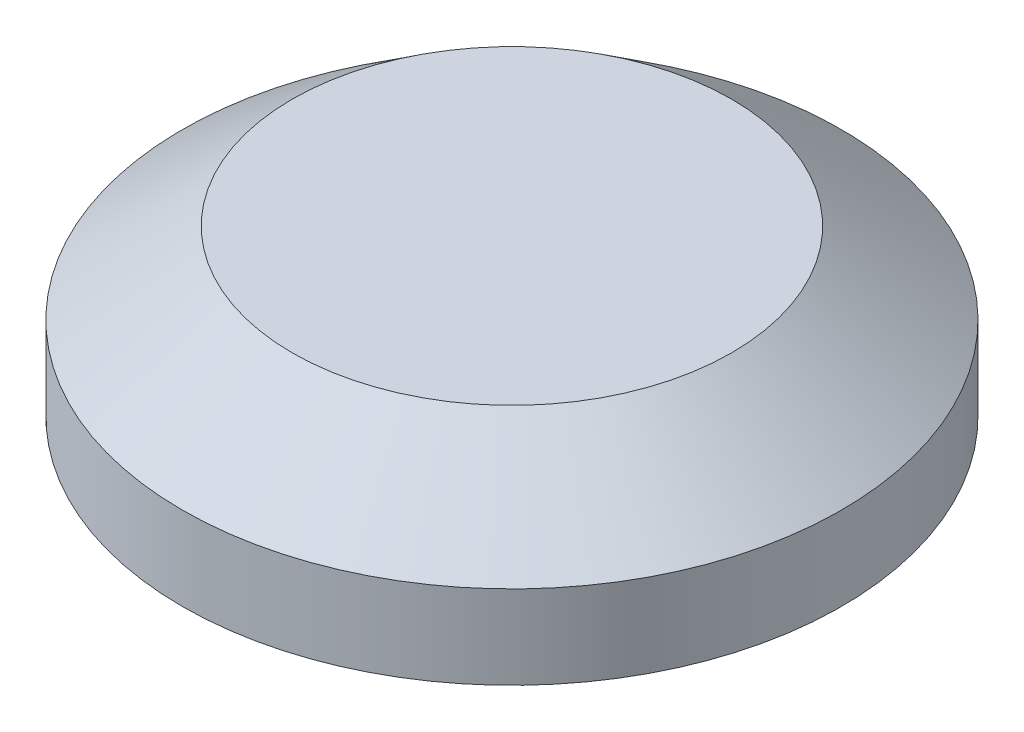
ISO-10303-21;
HEADER;
FILE_DESCRIPTION(('STEP AP214'),'2;1');
FILE_NAME('part.step','',(''),(''),'','','');
FILE_SCHEMA(('AUTOMOTIVE_DESIGN { 1 0 10303 214 1 1 1 1 }'));
ENDSEC;
DATA;
#1=APPLICATION_CONTEXT('core data for automotive mechanical design processes');
#2=APPLICATION_PROTOCOL_DEFINITION('international standard','automotive_design',2000,#1);
#3=PRODUCT_CONTEXT('',#1,'mechanical');
#4=PRODUCT('Part','Part','',(#3));
#5=PRODUCT_RELATED_PRODUCT_CATEGORY('part','',(#4));
#6=PRODUCT_DEFINITION_FORMATION('','',#4);
#7=PRODUCT_DEFINITION_CONTEXT('part definition',#1,'design');
#8=PRODUCT_DEFINITION('design','',#6,#7);
#9=PRODUCT_DEFINITION_SHAPE('','',#8);
#10=(LENGTH_UNIT() NAMED_UNIT(*) SI_UNIT(.MILLI.,.METRE.));
#11=(NAMED_UNIT(*) PLANE_ANGLE_UNIT() SI_UNIT($,.RADIAN.));
#12=(NAMED_UNIT(*) SI_UNIT($,.STERADIAN.) SOLID_ANGLE_UNIT());
#13=UNCERTAINTY_MEASURE_WITH_UNIT(LENGTH_MEASURE(1.E-05),#10,'distance_accuracy_value','');
#14=(GEOMETRIC_REPRESENTATION_CONTEXT(3) GLOBAL_UNCERTAINTY_ASSIGNED_CONTEXT((#13)) GLOBAL_UNIT_ASSIGNED_CONTEXT((#10,
#11,#12)) REPRESENTATION_CONTEXT('',''));
#15=CARTESIAN_POINT('',(0.,0.,0.));
#16=DIRECTION('',(0.,0.,1.));
#17=DIRECTION('',(1.,0.,0.));
#18=AXIS2_PLACEMENT_3D('',#15,#16,#17);
#19=CARTESIAN_POINT('',(0.,66.7243988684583,0.));
#20=DIRECTION('',(0.,1.,0.));
#21=DIRECTION('',(0.,0.,1.));
#22=AXIS2_PLACEMENT_3D('',#19,#20,#21);
#23=CYLINDRICAL_SURFACE('',#22,5.99999999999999);
#24=CARTESIAN_POINT('',(0.,0.,0.));
#25=DIRECTION('',(0.,1.,0.));
#26=DIRECTION('',(0.,0.,1.));
#27=AXIS2_PLACEMENT_3D('',#24,#25,#26);
#28=CIRCLE('',#27,5.99999999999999);
#29=CARTESIAN_POINT('',(0.,0.,5.99999999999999));
#30=VERTEX_POINT('',#29);
#31=EDGE_CURVE('E10',#30,#30,#28,.T.);
#32=ORIENTED_EDGE('',*,*,#31,.T.);
#33=EDGE_LOOP('',(#32));
#34=FACE_BOUND('',#33,.T.);
#35=CARTESIAN_POINT('',(0.,1.52028957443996,0.));
#36=DIRECTION('',(0.,1.,0.));
#37=DIRECTION('',(0.,0.,1.));
#38=AXIS2_PLACEMENT_3D('',#35,#36,#37);
#39=CIRCLE('',#38,5.99999999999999);
#40=CARTESIAN_POINT('',(0.,1.52028957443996,5.99999999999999));
#41=VERTEX_POINT('',#40);
#42=EDGE_CURVE('E40',#41,#41,#39,.T.);
#43=ORIENTED_EDGE('',*,*,#42,.F.);
#44=EDGE_LOOP('',(#43));
#45=FACE_BOUND('',#44,.T.);
#46=ADVANCED_FACE('F30',(#34,#45),#23,.T.);
#47=CARTESIAN_POINT('',(-5.99999999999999,0.,0.));
#48=DIRECTION('',(0.,-1.,0.));
#49=DIRECTION('',(0.,0.,-1.));
#50=AXIS2_PLACEMENT_3D('',#47,#48,#49);
#51=PLANE('',#50);
#52=ORIENTED_EDGE('',*,*,#31,.F.);
#53=EDGE_LOOP('',(#52));
#54=FACE_BOUND('',#53,.T.);
#55=ADVANCED_FACE('F51',(#54),#51,.T.);
#56=CARTESIAN_POINT('',(-3.99999999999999,3.,0.));
#57=DIRECTION('',(0.,1.,0.));
#58=DIRECTION('',(0.,0.,1.));
#59=AXIS2_PLACEMENT_3D('',#56,#57,#58);
#60=PLANE('',#59);
#61=CARTESIAN_POINT('',(0.,3.,0.));
#62=DIRECTION('',(0.,1.,0.));
#63=DIRECTION('',(0.,0.,1.));
#64=AXIS2_PLACEMENT_3D('',#61,#62,#63);
#65=CIRCLE('',#64,3.99999999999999);
#66=CARTESIAN_POINT('',(0.,3.,3.99999999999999));
#67=VERTEX_POINT('',#66);
#68=EDGE_CURVE('E36',#67,#67,#65,.T.);
#69=ORIENTED_EDGE('',*,*,#68,.T.);
#70=EDGE_LOOP('',(#69));
#71=FACE_BOUND('',#70,.T.);
#72=ADVANCED_FACE('F55',(#71),#60,.T.);
#73=CARTESIAN_POINT('',(0.,3.,0.));
#74=DIRECTION('',(0.,-1.,0.));
#75=DIRECTION('',(0.,0.,-1.));
#76=AXIS2_PLACEMENT_3D('',#73,#74,#75);
#77=CONICAL_SURFACE('',#76,3.99999999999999,0.933819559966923);
#78=ORIENTED_EDGE('',*,*,#42,.T.);
#79=EDGE_LOOP('',(#78));
#80=FACE_BOUND('',#79,.T.);
#81=ORIENTED_EDGE('',*,*,#68,.F.);
#82=EDGE_LOOP('',(#81));
#83=FACE_BOUND('',#82,.T.);
#84=ADVANCED_FACE('F47',(#80,#83),#77,.T.);
#85=CLOSED_SHELL('',(#46,#55,#72,#84));
#86=MANIFOLD_SOLID_BREP('B2',#85);
#87=ADVANCED_BREP_SHAPE_REPRESENTATION('',(#18,#86),#14);
#88=SHAPE_DEFINITION_REPRESENTATION(#9,#87);
ENDSEC;
END-ISO-10303-21;
